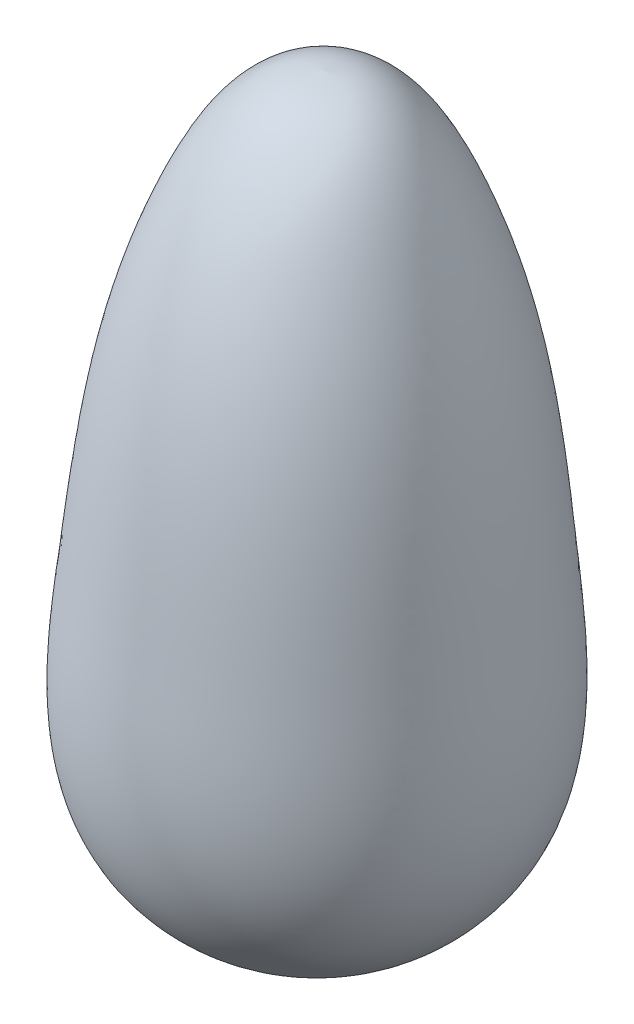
from build123d import *


with BuildPart() as part:
    # Skizze1 → Rotation1 (revolve)
    with BuildSketch(Plane.XY):
        with BuildLine():
            Line((0, 46.665089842), (-1.305317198, -44.377158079))
            add(Edge.make_bspline(
                [(0, 46.665089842), (-1.032891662, 46.589251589), (-8.107842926, 46.06978574), (-19.831944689, 25.065803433), (-22.685481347, -0.743230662), (-26.387494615, -30.920693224), (-12.037364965, -43.554645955), (-4.322162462, -44.145944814), (-1.305317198, -44.377158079)],
                knots=[0, 0, 0, 0, 0.027386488, 0.18758799, 0.539337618, 0.794528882, 0.919655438, 1, 1, 1, 1], degree=3))
        make_face()
    revolve(axis=Axis((0, 46.665089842, 0), (-0.01433601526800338, -0.9998972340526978, 0)))


solid = part.part
